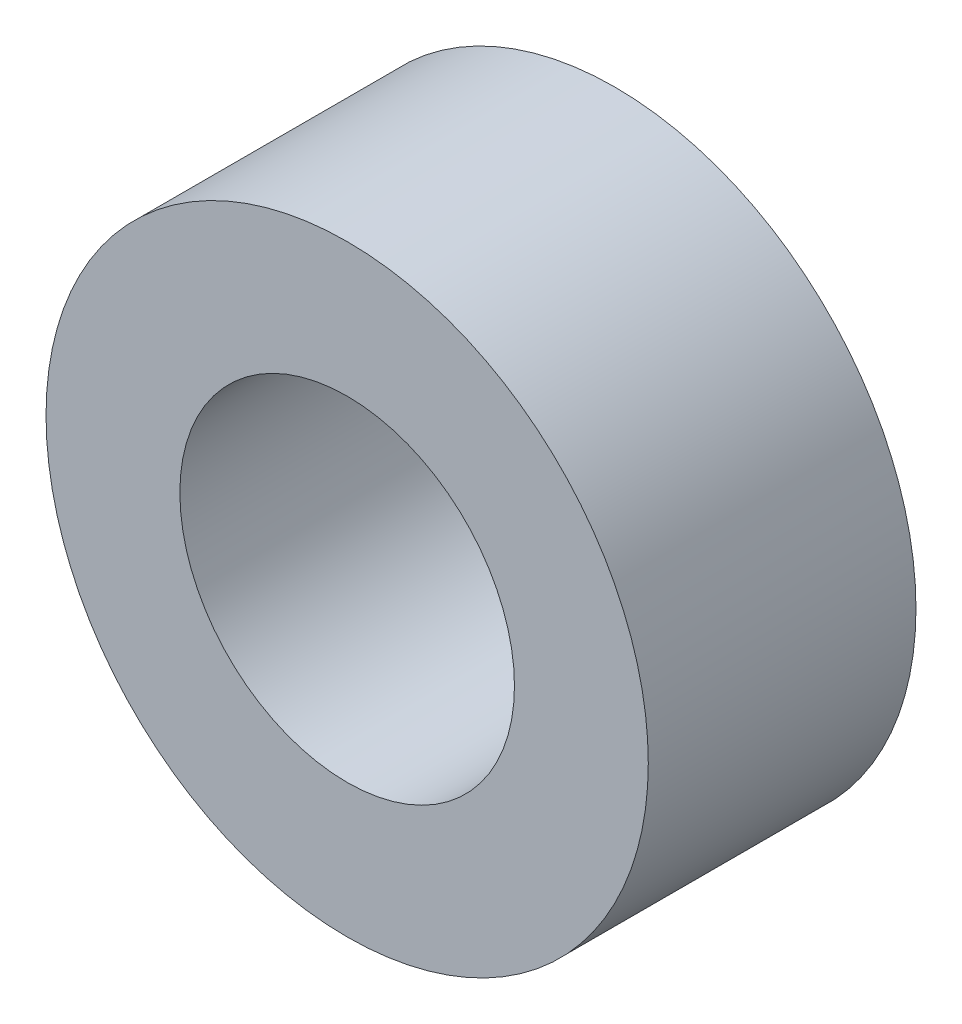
ISO-10303-21;
HEADER;
FILE_DESCRIPTION(('STEP AP214'),'2;1');
FILE_NAME('part.step','',(''),(''),'','','');
FILE_SCHEMA(('AUTOMOTIVE_DESIGN { 1 0 10303 214 1 1 1 1 }'));
ENDSEC;
DATA;
#1=APPLICATION_CONTEXT('core data for automotive mechanical design processes');
#2=APPLICATION_PROTOCOL_DEFINITION('international standard','automotive_design',2000,#1);
#3=PRODUCT_CONTEXT('',#1,'mechanical');
#4=PRODUCT('Part','Part','',(#3));
#5=PRODUCT_RELATED_PRODUCT_CATEGORY('part','',(#4));
#6=PRODUCT_DEFINITION_FORMATION('','',#4);
#7=PRODUCT_DEFINITION_CONTEXT('part definition',#1,'design');
#8=PRODUCT_DEFINITION('design','',#6,#7);
#9=PRODUCT_DEFINITION_SHAPE('','',#8);
#10=(LENGTH_UNIT() NAMED_UNIT(*) SI_UNIT(.MILLI.,.METRE.));
#11=(NAMED_UNIT(*) PLANE_ANGLE_UNIT() SI_UNIT($,.RADIAN.));
#12=(NAMED_UNIT(*) SI_UNIT($,.STERADIAN.) SOLID_ANGLE_UNIT());
#13=UNCERTAINTY_MEASURE_WITH_UNIT(LENGTH_MEASURE(1.E-05),#10,'distance_accuracy_value','');
#14=(GEOMETRIC_REPRESENTATION_CONTEXT(3) GLOBAL_UNCERTAINTY_ASSIGNED_CONTEXT((#13)) GLOBAL_UNIT_ASSIGNED_CONTEXT((#10,
#11,#12)) REPRESENTATION_CONTEXT('',''));
#15=CARTESIAN_POINT('',(0.,0.,0.));
#16=DIRECTION('',(0.,0.,1.));
#17=DIRECTION('',(1.,0.,0.));
#18=AXIS2_PLACEMENT_3D('',#15,#16,#17);
#19=CARTESIAN_POINT('',(0.,0.,4.));
#20=DIRECTION('',(0.,0.,1.));
#21=DIRECTION('',(1.,0.,0.));
#22=AXIS2_PLACEMENT_3D('',#19,#20,#21);
#23=PLANE('',#22);
#24=CARTESIAN_POINT('',(0.,0.,4.));
#25=DIRECTION('',(0.,0.,1.));
#26=DIRECTION('',(1.,0.,0.));
#27=AXIS2_PLACEMENT_3D('',#24,#25,#26);
#28=CIRCLE('',#27,4.5);
#29=CARTESIAN_POINT('',(4.5,0.,4.));
#30=VERTEX_POINT('',#29);
#31=EDGE_CURVE('E10',#30,#30,#28,.T.);
#32=ORIENTED_EDGE('',*,*,#31,.T.);
#33=EDGE_LOOP('',(#32));
#34=FACE_BOUND('',#33,.T.);
#35=CARTESIAN_POINT('',(0.,0.,4.));
#36=DIRECTION('',(0.,0.,1.));
#37=DIRECTION('',(1.,0.,0.));
#38=AXIS2_PLACEMENT_3D('',#35,#36,#37);
#39=CIRCLE('',#38,2.5);
#40=CARTESIAN_POINT('',(2.5,0.,4.));
#41=VERTEX_POINT('',#40);
#42=EDGE_CURVE('E45',#41,#41,#39,.T.);
#43=ORIENTED_EDGE('',*,*,#42,.F.);
#44=EDGE_LOOP('',(#43));
#45=FACE_BOUND('',#44,.T.);
#46=ADVANCED_FACE('F34',(#34,#45),#23,.T.);
#47=CARTESIAN_POINT('',(0.,0.,0.));
#48=DIRECTION('',(0.,0.,1.));
#49=DIRECTION('',(1.,0.,0.));
#50=AXIS2_PLACEMENT_3D('',#47,#48,#49);
#51=PLANE('',#50);
#52=CARTESIAN_POINT('',(0.,0.,0.));
#53=DIRECTION('',(0.,0.,1.));
#54=DIRECTION('',(1.,0.,0.));
#55=AXIS2_PLACEMENT_3D('',#52,#53,#54);
#56=CIRCLE('',#55,4.5);
#57=CARTESIAN_POINT('',(4.5,0.,0.));
#58=VERTEX_POINT('',#57);
#59=EDGE_CURVE('E38',#58,#58,#56,.T.);
#60=ORIENTED_EDGE('',*,*,#59,.F.);
#61=EDGE_LOOP('',(#60));
#62=FACE_BOUND('',#61,.T.);
#63=CARTESIAN_POINT('',(0.,0.,0.));
#64=DIRECTION('',(0.,0.,1.));
#65=DIRECTION('',(1.,0.,0.));
#66=AXIS2_PLACEMENT_3D('',#63,#64,#65);
#67=CIRCLE('',#66,2.5);
#68=CARTESIAN_POINT('',(2.5,0.,0.));
#69=VERTEX_POINT('',#68);
#70=EDGE_CURVE('E47',#69,#69,#67,.T.);
#71=ORIENTED_EDGE('',*,*,#70,.T.);
#72=EDGE_LOOP('',(#71));
#73=FACE_BOUND('',#72,.T.);
#74=ADVANCED_FACE('F57',(#62,#73),#51,.F.);
#75=CARTESIAN_POINT('',(0.,0.,4.));
#76=DIRECTION('',(0.,0.,-1.));
#77=DIRECTION('',(-1.,0.,0.));
#78=AXIS2_PLACEMENT_3D('',#75,#76,#77);
#79=CYLINDRICAL_SURFACE('',#78,4.5);
#80=ORIENTED_EDGE('',*,*,#31,.F.);
#81=EDGE_LOOP('',(#80));
#82=FACE_BOUND('',#81,.T.);
#83=ORIENTED_EDGE('',*,*,#59,.T.);
#84=EDGE_LOOP('',(#83));
#85=FACE_BOUND('',#84,.T.);
#86=ADVANCED_FACE('F36',(#82,#85),#79,.T.);
#87=CARTESIAN_POINT('',(0.,0.,4.));
#88=DIRECTION('',(0.,0.,-1.));
#89=DIRECTION('',(-1.,0.,0.));
#90=AXIS2_PLACEMENT_3D('',#87,#88,#89);
#91=CYLINDRICAL_SURFACE('',#90,2.5);
#92=ORIENTED_EDGE('',*,*,#42,.T.);
#93=EDGE_LOOP('',(#92));
#94=FACE_BOUND('',#93,.T.);
#95=ORIENTED_EDGE('',*,*,#70,.F.);
#96=EDGE_LOOP('',(#95));
#97=FACE_BOUND('',#96,.T.);
#98=ADVANCED_FACE('F53',(#94,#97),#91,.F.);
#99=CLOSED_SHELL('',(#46,#74,#86,#98));
#100=MANIFOLD_SOLID_BREP('B2',#99);
#101=ADVANCED_BREP_SHAPE_REPRESENTATION('',(#18,#100),#14);
#102=SHAPE_DEFINITION_REPRESENTATION(#9,#101);
ENDSEC;
END-ISO-10303-21;
